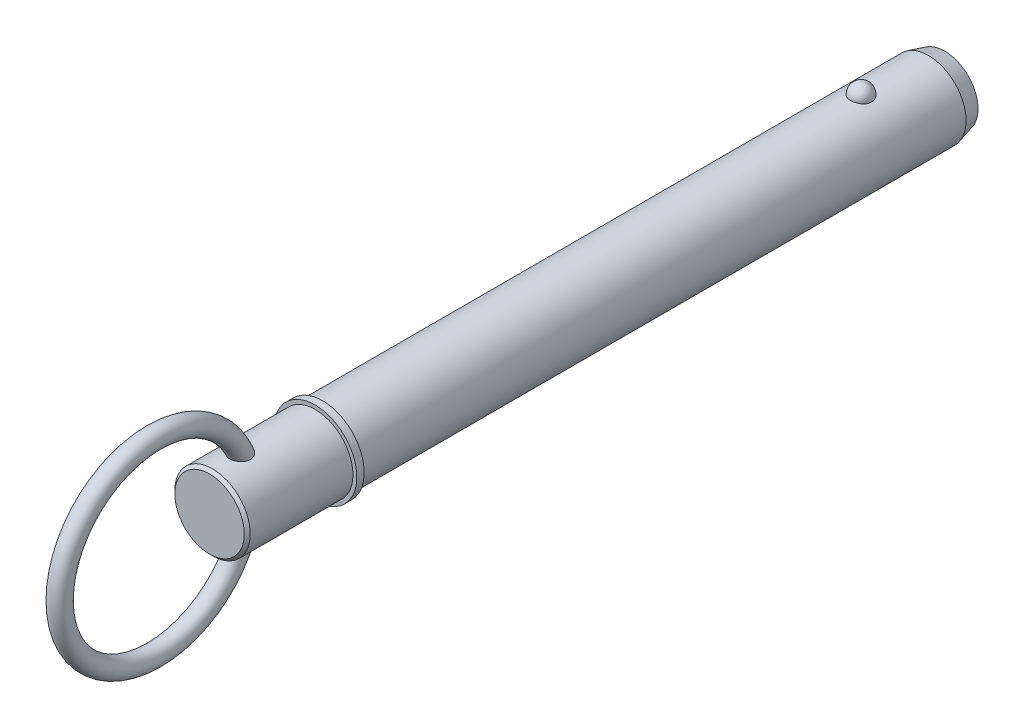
ISO-10303-21;
HEADER;
FILE_DESCRIPTION(('STEP AP214'),'2;1');
FILE_NAME('part.step','',(''),(''),'','','');
FILE_SCHEMA(('AUTOMOTIVE_DESIGN { 1 0 10303 214 1 1 1 1 }'));
ENDSEC;
DATA;
#1=APPLICATION_CONTEXT('core data for automotive mechanical design processes');
#2=APPLICATION_PROTOCOL_DEFINITION('international standard','automotive_design',2000,#1);
#3=PRODUCT_CONTEXT('',#1,'mechanical');
#4=PRODUCT('Part','Part','',(#3));
#5=PRODUCT_RELATED_PRODUCT_CATEGORY('part','',(#4));
#6=PRODUCT_DEFINITION_FORMATION('','',#4);
#7=PRODUCT_DEFINITION_CONTEXT('part definition',#1,'design');
#8=PRODUCT_DEFINITION('design','',#6,#7);
#9=PRODUCT_DEFINITION_SHAPE('','',#8);
#10=(LENGTH_UNIT() NAMED_UNIT(*) SI_UNIT(.MILLI.,.METRE.));
#11=(NAMED_UNIT(*) PLANE_ANGLE_UNIT() SI_UNIT($,.RADIAN.));
#12=(NAMED_UNIT(*) SI_UNIT($,.STERADIAN.) SOLID_ANGLE_UNIT());
#13=UNCERTAINTY_MEASURE_WITH_UNIT(LENGTH_MEASURE(1.E-05),#10,'distance_accuracy_value','');
#14=(GEOMETRIC_REPRESENTATION_CONTEXT(3) GLOBAL_UNCERTAINTY_ASSIGNED_CONTEXT((#13)) GLOBAL_UNIT_ASSIGNED_CONTEXT((#10,
#11,#12)) REPRESENTATION_CONTEXT('',''));
#15=CARTESIAN_POINT('',(0.,0.,0.));
#16=DIRECTION('',(0.,0.,1.));
#17=DIRECTION('',(1.,0.,0.));
#18=AXIS2_PLACEMENT_3D('',#15,#16,#17);
#19=CARTESIAN_POINT('',(0.,0.,177.8));
#20=DIRECTION('',(0.,0.,-1.));
#21=DIRECTION('',(-1.,0.,0.));
#22=AXIS2_PLACEMENT_3D('',#19,#20,#21);
#23=CYLINDRICAL_SURFACE('',#22,12.7);
#24=CARTESIAN_POINT('',(3.52486003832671,12.2010393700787,-3.56));
#25=CARTESIAN_POINT('',(3.52485671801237,12.2010422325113,-3.3610062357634));
#26=CARTESIAN_POINT('',(3.50863187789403,12.2057632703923,-3.16197042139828));
#27=CARTESIAN_POINT('',(3.4441205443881,12.2241207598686,-2.76953945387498));
#28=CARTESIAN_POINT('',(3.39582213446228,12.2377605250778,-2.57614642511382));
#29=CARTESIAN_POINT('',(3.26839193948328,12.2724057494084,-2.20059799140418));
#30=CARTESIAN_POINT('',(3.18927369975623,12.2934079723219,-2.01843769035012));
#31=CARTESIAN_POINT('',(3.00217139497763,12.3404306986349,-1.6703228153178));
#32=CARTESIAN_POINT('',(2.89418796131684,12.3664510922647,-1.50436788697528));
#33=CARTESIAN_POINT('',(2.65144862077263,12.4207616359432,-1.19241975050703));
#34=CARTESIAN_POINT('',(2.51656310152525,12.4490623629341,-1.04652919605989));
#35=CARTESIAN_POINT('',(2.22383249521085,12.5046678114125,-0.779711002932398));
#36=CARTESIAN_POINT('',(2.0659873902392,12.5319725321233,-0.658783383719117));
#37=CARTESIAN_POINT('',(1.73204520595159,12.5824645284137,-0.445586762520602));
#38=CARTESIAN_POINT('',(1.55600183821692,12.6056634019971,-0.353236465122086));
#39=CARTESIAN_POINT('',(1.19021695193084,12.6454411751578,-0.199381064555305));
#40=CARTESIAN_POINT('',(1.00047694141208,12.6620208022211,-0.137872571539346));
#41=CARTESIAN_POINT('',(0.616329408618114,12.6864692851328,-0.0483191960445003));
#42=CARTESIAN_POINT('',(0.422067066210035,12.6944893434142,-0.0196927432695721));
#43=CARTESIAN_POINT('',(0.0313259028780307,12.7014637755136,0.00524116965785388));
#44=CARTESIAN_POINT('',(-0.165152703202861,12.7004190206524,0.00155173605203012));
#45=CARTESIAN_POINT('',(-0.551780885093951,12.6894611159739,-0.0377454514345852));
#46=CARTESIAN_POINT('',(-0.74198078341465,12.6796749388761,-0.0728962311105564));
#47=CARTESIAN_POINT('',(-1.11361063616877,12.6524544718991,-0.173489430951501));
#48=CARTESIAN_POINT('',(-1.29504043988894,12.6350200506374,-0.238932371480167));
#49=CARTESIAN_POINT('',(-1.64521311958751,12.5942270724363,-0.398772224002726));
#50=CARTESIAN_POINT('',(-1.81387645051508,12.5708347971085,-0.493334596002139));
#51=CARTESIAN_POINT('',(-2.13292959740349,12.5206522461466,-0.708731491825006));
#52=CARTESIAN_POINT('',(-2.28331755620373,12.4938616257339,-0.829568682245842));
#53=CARTESIAN_POINT('',(-2.56470285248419,12.4391828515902,-1.0968714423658));
#54=CARTESIAN_POINT('',(-2.69527522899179,12.4112835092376,-1.24378221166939));
#55=CARTESIAN_POINT('',(-2.93023079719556,12.3579248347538,-1.55763192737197));
#56=CARTESIAN_POINT('',(-3.03461212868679,12.3324656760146,-1.72457229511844));
#57=CARTESIAN_POINT('',(-3.21564423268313,12.2865167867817,-2.07598316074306));
#58=CARTESIAN_POINT('',(-3.29196222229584,12.2660875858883,-2.26063321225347));
#59=CARTESIAN_POINT('',(-3.41323771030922,12.2328979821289,-2.64061334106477));
#60=CARTESIAN_POINT('',(-3.45819611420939,12.2201373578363,-2.83594310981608));
#61=CARTESIAN_POINT('',(-3.51550038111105,12.2037762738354,-3.2308649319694));
#62=CARTESIAN_POINT('',(-3.5279827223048,12.200137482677,-3.43043558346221));
#63=CARTESIAN_POINT('',(-3.52041430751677,12.2023234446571,-3.8289025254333));
#64=CARTESIAN_POINT('',(-3.50036443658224,12.2081479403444,-4.02779883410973));
#65=CARTESIAN_POINT('',(-3.42842010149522,12.2285446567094,-4.41824213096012));
#66=CARTESIAN_POINT('',(-3.37668525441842,12.243073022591,-4.6098208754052));
#67=CARTESIAN_POINT('',(-3.24279085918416,12.2792134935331,-4.98132360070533));
#68=CARTESIAN_POINT('',(-3.16063009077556,12.300825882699,-5.16124711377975));
#69=CARTESIAN_POINT('',(-2.96738224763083,12.3488691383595,-5.50542856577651));
#70=CARTESIAN_POINT('',(-2.85613997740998,12.3753256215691,-5.66959579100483));
#71=CARTESIAN_POINT('',(-2.60773241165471,12.4300386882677,-5.97665065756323));
#72=CARTESIAN_POINT('',(-2.47056612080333,12.458295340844,-6.11953748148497));
#73=CARTESIAN_POINT('',(-2.17327999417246,12.5135827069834,-6.38059312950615));
#74=CARTESIAN_POINT('',(-2.01307652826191,12.5406084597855,-6.49866785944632));
#75=CARTESIAN_POINT('',(-1.67442544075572,12.5902954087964,-6.70609314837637));
#76=CARTESIAN_POINT('',(-1.49597909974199,12.6129569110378,-6.79544572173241));
#77=CARTESIAN_POINT('',(-1.12819666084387,12.6511224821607,-6.94192787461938));
#78=CARTESIAN_POINT('',(-0.93902400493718,12.666712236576,-6.99944518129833));
#79=CARTESIAN_POINT('',(-0.553267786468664,12.6894125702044,-7.08227444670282));
#80=CARTESIAN_POINT('',(-0.356685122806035,12.6965241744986,-7.10759029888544));
#81=CARTESIAN_POINT('',(0.0343320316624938,12.7014305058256,-7.12510946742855));
#82=CARTESIAN_POINT('',(0.228736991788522,12.6993986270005,-7.11792901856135));
#83=CARTESIAN_POINT('',(0.613493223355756,12.6866339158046,-7.07206766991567));
#84=CARTESIAN_POINT('',(0.803844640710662,12.6759013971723,-7.03338790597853));
#85=CARTESIAN_POINT('',(1.17440741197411,12.6469443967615,-6.925834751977));
#86=CARTESIAN_POINT('',(1.35465462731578,12.6287486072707,-6.85707692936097));
#87=CARTESIAN_POINT('',(1.70092526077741,12.5867908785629,-6.69128257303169));
#88=CARTESIAN_POINT('',(1.86694777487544,12.5630285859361,-6.59424424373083));
#89=CARTESIAN_POINT('',(2.18289085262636,12.5120350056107,-6.3727748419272));
#90=CARTESIAN_POINT('',(2.33252391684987,12.4847559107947,-6.24794475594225));
#91=CARTESIAN_POINT('',(2.60889724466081,12.4299457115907,-5.97511730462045));
#92=CARTESIAN_POINT('',(2.73563353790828,12.4024145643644,-5.82711592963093));
#93=CARTESIAN_POINT('',(2.96505559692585,12.3495984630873,-5.5091226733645));
#94=CARTESIAN_POINT('',(3.06728335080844,12.3243610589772,-5.33879227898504));
#95=CARTESIAN_POINT('',(3.24218794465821,12.2795120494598,-4.98295005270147));
#96=CARTESIAN_POINT('',(3.31487538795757,12.2598984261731,-4.79744369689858));
#97=CARTESIAN_POINT('',(3.42255689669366,12.2302435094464,-4.43775244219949));
#98=CARTESIAN_POINT('',(3.46085292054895,12.2193780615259,-4.264615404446));
#99=CARTESIAN_POINT('',(3.5120056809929,12.2047747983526,-3.9143299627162));
#100=CARTESIAN_POINT('',(3.52486299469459,12.2010368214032,-3.73718164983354));
#101=CARTESIAN_POINT('',(3.52486003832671,12.2010393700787,-3.56));
#102=B_SPLINE_CURVE_WITH_KNOTS('',3,(#24,#25,#26,#27,#28,#29,#30,#31,#32,#33,#34,#35,#36,#37,
#38,#39,#40,#41,#42,#43,#44,#45,#46,#47,#48,#49,#50,#51,#52,#53,#54,#55,#56,#57,#58,#59,#60,#61,
#62,#63,#64,#65,#66,#67,#68,#69,#70,#71,#72,#73,#74,#75,#76,#77,#78,#79,#80,#81,#82,#83,#84,#85,
#86,#87,#88,#89,#90,#91,#92,#93,#94,#95,#96,#97,#98,#99,#100,#101),.UNSPECIFIED.,.T.,.F.,(4,2,2,
2,2,2,2,2,2,2,2,2,2,2,2,2,2,2,2,2,2,2,2,2,2,2,2,2,2,2,2,2,2,2,2,2,2,2,4),(0.,0.596344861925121,
1.19291141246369,1.78921606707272,2.38550767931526,2.98474477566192,3.58398233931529,
4.18149920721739,4.77895038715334,5.36566361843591,5.95232045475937,6.53059198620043,
7.10887345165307,7.6905033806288,8.27219236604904,8.86498552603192,9.45782077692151,
10.0574751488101,10.6571122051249,11.2542252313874,11.8513220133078,12.4454353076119,
13.0395724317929,13.636947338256,14.2343451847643,14.8339691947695,15.4335511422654,
16.0256602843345,16.6176978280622,17.1985559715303,17.7793931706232,18.3580179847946,
18.9366795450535,19.5242567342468,20.1119357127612,20.7098642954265,21.3075780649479,
21.8385683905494,22.3695466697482),.UNSPECIFIED.);
#103=CARTESIAN_POINT('',(3.52486003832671,12.2010393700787,-3.56));
#104=VERTEX_POINT('',#103);
#105=EDGE_CURVE('E101',#104,#104,#102,.T.);
#106=ORIENTED_EDGE('',*,*,#105,.T.);
#107=EDGE_LOOP('',(#106));
#108=FACE_BOUND('',#107,.T.);
#109=CARTESIAN_POINT('',(0.,0.,-26.2499999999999));
#110=DIRECTION('',(0.,0.,-1.));
#111=DIRECTION('',(-1.,0.,0.));
#112=AXIS2_PLACEMENT_3D('',#109,#110,#111);
#113=CIRCLE('',#112,12.7);
#114=CARTESIAN_POINT('',(-12.7,0.,-26.2499999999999));
#115=VERTEX_POINT('',#114);
#116=EDGE_CURVE('E109',#115,#115,#113,.F.);
#117=ORIENTED_EDGE('',*,*,#116,.T.);
#118=EDGE_LOOP('',(#117));
#119=FACE_BOUND('',#118,.T.);
#120=CARTESIAN_POINT('',(0.,0.,177.8));
#121=DIRECTION('',(0.,0.,1.));
#122=DIRECTION('',(1.,0.,0.));
#123=AXIS2_PLACEMENT_3D('',#120,#121,#122);
#124=CIRCLE('',#123,12.7);
#125=CARTESIAN_POINT('',(12.7,0.,177.8));
#126=VERTEX_POINT('',#125);
#127=EDGE_CURVE('E107',#126,#126,#124,.T.);
#128=ORIENTED_EDGE('',*,*,#127,.F.);
#129=EDGE_LOOP('',(#128));
#130=FACE_BOUND('',#129,.T.);
#131=ADVANCED_FACE('F39',(#108,#119,#130),#23,.T.);
#132=CARTESIAN_POINT('',(0.,0.,-31.75));
#133=DIRECTION('',(0.,0.,-1.));
#134=DIRECTION('',(-1.,0.,0.));
#135=AXIS2_PLACEMENT_3D('',#132,#133,#134);
#136=PLANE('',#135);
#137=CARTESIAN_POINT('',(0.,0.,-31.75));
#138=DIRECTION('',(0.,0.,-1.));
#139=DIRECTION('',(-1.,0.,0.));
#140=AXIS2_PLACEMENT_3D('',#137,#138,#139);
#141=CIRCLE('',#140,11.2262794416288);
#142=CARTESIAN_POINT('',(-11.2262794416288,0.,-31.75));
#143=VERTEX_POINT('',#142);
#144=EDGE_CURVE('E141',#143,#143,#141,.T.);
#145=ORIENTED_EDGE('',*,*,#144,.T.);
#146=EDGE_LOOP('',(#145));
#147=FACE_BOUND('',#146,.T.);
#148=ADVANCED_FACE('F87',(#147),#136,.T.);
#149=CARTESIAN_POINT('',(0.,0.,-31.75));
#150=DIRECTION('',(0.,0.,1.));
#151=DIRECTION('',(1.,0.,0.));
#152=AXIS2_PLACEMENT_3D('',#149,#150,#151);
#153=CONICAL_SURFACE('',#152,11.2262794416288,0.261799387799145);
#154=ORIENTED_EDGE('',*,*,#116,.F.);
#155=EDGE_LOOP('',(#154));
#156=FACE_BOUND('',#155,.T.);
#157=ORIENTED_EDGE('',*,*,#144,.F.);
#158=EDGE_LOOP('',(#157));
#159=FACE_BOUND('',#158,.T.);
#160=ADVANCED_FACE('F93',(#156,#159),#153,.T.);
#161=CARTESIAN_POINT('',(0.,12.7,-3.56));
#162=DIRECTION('',(0.,1.,0.));
#163=DIRECTION('',(0.,0.,1.));
#164=AXIS2_PLACEMENT_3D('',#161,#162,#163);
#165=SPHERICAL_SURFACE('',#164,3.56);
#166=ORIENTED_EDGE('',*,*,#105,.F.);
#167=EDGE_LOOP('',(#166));
#168=FACE_BOUND('',#167,.T.);
#169=ADVANCED_FACE('F112',(#168),#165,.T.);
#170=CARTESIAN_POINT('',(0.,0.,177.8));
#171=DIRECTION('',(0.,0.,-1.));
#172=DIRECTION('',(-1.,0.,0.));
#173=AXIS2_PLACEMENT_3D('',#170,#171,#172);
#174=PLANE('',#173);
#175=ORIENTED_EDGE('',*,*,#127,.T.);
#176=EDGE_LOOP('',(#175));
#177=FACE_BOUND('',#176,.T.);
#178=CARTESIAN_POINT('',(0.,0.,177.8));
#179=DIRECTION('',(0.,0.,-1.));
#180=DIRECTION('',(-1.,0.,0.));
#181=AXIS2_PLACEMENT_3D('',#178,#179,#180);
#182=CIRCLE('',#181,14.);
#183=CARTESIAN_POINT('',(-14.,0.,177.8));
#184=VERTEX_POINT('',#183);
#185=EDGE_CURVE('E108',#184,#184,#182,.T.);
#186=ORIENTED_EDGE('',*,*,#185,.T.);
#187=EDGE_LOOP('',(#186));
#188=FACE_BOUND('',#187,.T.);
#189=ADVANCED_FACE('F116',(#177,#188),#174,.T.);
#190=CARTESIAN_POINT('',(0.,0.,33.7287874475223));
#191=DIRECTION('',(0.,0.,-1.));
#192=DIRECTION('',(-1.,0.,0.));
#193=AXIS2_PLACEMENT_3D('',#190,#191,#192);
#194=CYLINDRICAL_SURFACE('',#193,14.);
#195=CARTESIAN_POINT('',(0.,0.,180.3));
#196=DIRECTION('',(0.,0.,-1.));
#197=DIRECTION('',(-1.,0.,0.));
#198=AXIS2_PLACEMENT_3D('',#195,#196,#197);
#199=CIRCLE('',#198,14.);
#200=CARTESIAN_POINT('',(-14.,0.,180.3));
#201=VERTEX_POINT('',#200);
#202=EDGE_CURVE('E133',#201,#201,#199,.T.);
#203=ORIENTED_EDGE('',*,*,#202,.T.);
#204=EDGE_LOOP('',(#203));
#205=FACE_BOUND('',#204,.T.);
#206=ORIENTED_EDGE('',*,*,#185,.F.);
#207=EDGE_LOOP('',(#206));
#208=FACE_BOUND('',#207,.T.);
#209=ADVANCED_FACE('F120',(#205,#208),#194,.T.);
#210=CARTESIAN_POINT('',(0.,14.,180.3));
#211=DIRECTION('',(0.,0.,1.));
#212=DIRECTION('',(1.,0.,0.));
#213=AXIS2_PLACEMENT_3D('',#210,#211,#212);
#214=PLANE('',#213);
#215=CARTESIAN_POINT('',(0.,0.,180.3));
#216=DIRECTION('',(0.,0.,1.));
#217=DIRECTION('',(1.,0.,0.));
#218=AXIS2_PLACEMENT_3D('',#215,#216,#217);
#219=CIRCLE('',#218,12.7);
#220=CARTESIAN_POINT('',(12.7,0.,180.3));
#221=VERTEX_POINT('',#220);
#222=EDGE_CURVE('E111',#221,#221,#219,.T.);
#223=ORIENTED_EDGE('',*,*,#222,.F.);
#224=EDGE_LOOP('',(#223));
#225=FACE_BOUND('',#224,.T.);
#226=ORIENTED_EDGE('',*,*,#202,.F.);
#227=EDGE_LOOP('',(#226));
#228=FACE_BOUND('',#227,.T.);
#229=ADVANCED_FACE('F84',(#225,#228),#214,.T.);
#230=CARTESIAN_POINT('',(0.,0.,215.9));
#231=DIRECTION('',(0.,0.,-1.));
#232=DIRECTION('',(-1.,0.,0.));
#233=AXIS2_PLACEMENT_3D('',#230,#231,#232);
#234=CYLINDRICAL_SURFACE('',#233,12.7);
#235=CARTESIAN_POINT('',(-1.22892607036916,-12.6404011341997,202.27119395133));
#236=CARTESIAN_POINT('',(-1.06119922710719,-12.6567092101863,202.204004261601));
#237=CARTESIAN_POINT('',(-0.887663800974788,-12.6701810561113,202.150792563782));
#238=CARTESIAN_POINT('',(-0.533823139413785,-12.6900116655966,202.073419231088));
#239=CARTESIAN_POINT('',(-0.353518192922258,-12.6963707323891,202.0492563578));
#240=CARTESIAN_POINT('',(0.0087115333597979,-12.7012887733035,202.030519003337));
#241=CARTESIAN_POINT('',(0.190636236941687,-12.699848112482,202.035943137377));
#242=CARTESIAN_POINT('',(0.5509718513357,-12.6893231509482,202.076255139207));
#243=CARTESIAN_POINT('',(0.729382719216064,-12.6802387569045,202.11114336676));
#244=CARTESIAN_POINT('',(1.07771687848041,-12.6553960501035,202.209659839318));
#245=CARTESIAN_POINT('',(1.24763507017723,-12.6396337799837,202.273305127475));
#246=CARTESIAN_POINT('',(1.57398922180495,-12.6031560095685,202.427891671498));
#247=CARTESIAN_POINT('',(1.73042571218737,-12.5824407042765,202.518831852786));
#248=CARTESIAN_POINT('',(2.02464767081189,-12.5384554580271,202.725320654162));
#249=CARTESIAN_POINT('',(2.16251370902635,-12.5151974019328,202.84075697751));
#250=CARTESIAN_POINT('',(2.41652917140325,-12.4686447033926,203.093426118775));
#251=CARTESIAN_POINT('',(2.53268123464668,-12.4453500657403,203.230656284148));
#252=CARTESIAN_POINT('',(2.7397169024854,-12.4014166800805,203.52226178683));
#253=CARTESIAN_POINT('',(2.83072997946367,-12.3807646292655,203.676543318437));
#254=CARTESIAN_POINT('',(2.98642630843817,-12.3441356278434,203.998338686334));
#255=CARTESIAN_POINT('',(3.05110876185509,-12.3281588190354,204.165852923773));
#256=CARTESIAN_POINT('',(3.15450336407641,-12.3021148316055,204.512705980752));
#257=CARTESIAN_POINT('',(3.19268116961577,-12.2921697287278,204.692212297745));
#258=CARTESIAN_POINT('',(3.24150148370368,-12.2793848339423,205.055144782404));
#259=CARTESIAN_POINT('',(3.25213515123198,-12.2765473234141,205.238572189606));
#260=CARTESIAN_POINT('',(3.24696781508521,-12.2779158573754,205.618893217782));
#261=CARTESIAN_POINT('',(3.22910261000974,-12.2826719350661,205.815753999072));
#262=CARTESIAN_POINT('',(3.16504953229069,-12.2993299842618,206.20447917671));
#263=CARTESIAN_POINT('',(3.11884966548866,-12.3112349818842,206.396341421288));
#264=CARTESIAN_POINT('',(2.99323123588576,-12.3424162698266,206.792891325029));
#265=CARTESIAN_POINT('',(2.91059577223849,-12.3623844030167,206.996505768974));
#266=CARTESIAN_POINT('',(2.71447440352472,-12.4069229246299,207.388190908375));
#267=CARTESIAN_POINT('',(2.60094970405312,-12.431499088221,207.576241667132));
#268=CARTESIAN_POINT('',(2.40499526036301,-12.4703951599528,207.847470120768));
#269=CARTESIAN_POINT('',(2.3330184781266,-12.4841083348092,207.938407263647));
#270=CARTESIAN_POINT('',(2.18106597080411,-12.5115521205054,208.113320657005));
#271=CARTESIAN_POINT('',(2.10108885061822,-12.5252827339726,208.197295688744));
#272=CARTESIAN_POINT('',(1.8497396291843,-12.5657115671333,208.436779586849));
#273=CARTESIAN_POINT('',(1.6664677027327,-12.5917488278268,208.580526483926));
#274=CARTESIAN_POINT('',(1.33551340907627,-12.6303067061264,208.785856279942));
#275=CARTESIAN_POINT('',(1.1951213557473,-12.6444898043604,208.85902243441));
#276=CARTESIAN_POINT('',(0.90394580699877,-12.6686276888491,208.981586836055));
#277=CARTESIAN_POINT('',(0.753173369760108,-12.6785868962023,209.031009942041));
#278=CARTESIAN_POINT('',(0.444090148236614,-12.6931800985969,209.102942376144));
#279=CARTESIAN_POINT('',(0.285741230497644,-12.6977833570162,209.125296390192));
#280=CARTESIAN_POINT('',(-0.0324491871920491,-12.700953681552,209.140724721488));
#281=CARTESIAN_POINT('',(-0.19229038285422,-12.6995219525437,209.133804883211));
#282=CARTESIAN_POINT('',(-0.493822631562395,-12.6912132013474,209.093209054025));
#283=CARTESIAN_POINT('',(-0.635865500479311,-12.6848307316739,209.061962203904));
#284=CARTESIAN_POINT('',(-0.913041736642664,-12.6678986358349,208.977721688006));
#285=CARTESIAN_POINT('',(-1.04817349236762,-12.6573480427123,208.924722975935));
#286=CARTESIAN_POINT('',(-1.31637898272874,-12.6323524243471,208.796233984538));
#287=CARTESIAN_POINT('',(-1.44890088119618,-12.6177203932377,208.719638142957));
#288=CARTESIAN_POINT('',(-1.70162176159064,-12.5861326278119,208.548743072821));
#289=CARTESIAN_POINT('',(-1.82181486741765,-12.569175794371,208.454435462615));
#290=CARTESIAN_POINT('',(-2.06961284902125,-12.5309682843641,208.232665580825));
#291=CARTESIAN_POINT('',(-2.19457628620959,-12.5094982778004,208.10229330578));
#292=CARTESIAN_POINT('',(-2.42503767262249,-12.4668738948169,207.825308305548));
#293=CARTESIAN_POINT('',(-2.53052086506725,-12.4457197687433,207.678683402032));
#294=CARTESIAN_POINT('',(-2.73961150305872,-12.4015349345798,207.343065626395));
#295=CARTESIAN_POINT('',(-2.83895917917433,-12.3789253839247,207.151346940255));
#296=CARTESIAN_POINT('',(-3.00725804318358,-12.3391195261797,206.754405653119));
#297=CARTESIAN_POINT('',(-3.0761885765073,-12.3219268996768,206.549173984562));
#298=CARTESIAN_POINT('',(-3.18528660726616,-12.2942052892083,206.113754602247));
#299=CARTESIAN_POINT('',(-3.22287145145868,-12.2842816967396,205.882855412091));
#300=CARTESIAN_POINT('',(-3.24821271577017,-12.2775854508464,205.534351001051));
#301=CARTESIAN_POINT('',(-3.25148236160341,-12.276719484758,205.417777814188));
#302=CARTESIAN_POINT('',(-3.24729041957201,-12.2778310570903,205.184859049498));
#303=CARTESIAN_POINT('',(-3.23983534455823,-12.2798068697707,205.068513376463));
#304=CARTESIAN_POINT('',(-3.21488959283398,-12.286359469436,204.84622762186));
#305=CARTESIAN_POINT('',(-3.19823165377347,-12.2907201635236,204.740186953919));
#306=CARTESIAN_POINT('',(-3.15537465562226,-12.3017926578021,204.53022257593));
#307=CARTESIAN_POINT('',(-3.12918076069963,-12.3085031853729,204.426297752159));
#308=CARTESIAN_POINT('',(-3.06721568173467,-12.3240904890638,204.221553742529));
#309=CARTESIAN_POINT('',(-3.0314485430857,-12.3329663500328,204.120733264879));
#310=CARTESIAN_POINT('',(-2.95042598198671,-12.3525998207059,203.923171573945));
#311=CARTESIAN_POINT('',(-2.90517160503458,-12.3633572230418,203.826429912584));
#312=CARTESIAN_POINT('',(-2.81116315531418,-12.3850478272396,203.648857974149));
#313=CARTESIAN_POINT('',(-2.76340897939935,-12.3958187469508,203.567476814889));
#314=CARTESIAN_POINT('',(-2.66091958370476,-12.4182228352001,203.409317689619));
#315=CARTESIAN_POINT('',(-2.60618212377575,-12.4298562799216,203.332541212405));
#316=CARTESIAN_POINT('',(-2.4901313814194,-12.4536239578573,203.184278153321));
#317=CARTESIAN_POINT('',(-2.42882150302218,-12.4657579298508,203.112788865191));
#318=CARTESIAN_POINT('',(-2.30002146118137,-12.4901640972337,202.975587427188));
#319=CARTESIAN_POINT('',(-2.23252894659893,-12.5024363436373,202.909877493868));
#320=CARTESIAN_POINT('',(-2.09370795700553,-12.5264205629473,202.786377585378));
#321=CARTESIAN_POINT('',(-2.02252382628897,-12.5381388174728,202.728426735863));
#322=CARTESIAN_POINT('',(-1.87531735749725,-12.5610012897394,202.61889123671));
#323=CARTESIAN_POINT('',(-1.79929316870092,-12.5721452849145,202.567309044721));
#324=CARTESIAN_POINT('',(-1.56485282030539,-12.6042047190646,202.422706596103));
#325=CARTESIAN_POINT('',(-1.39990754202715,-12.6237766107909,202.339687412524));
#326=CARTESIAN_POINT('',(-1.22892607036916,-12.6404011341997,202.27119395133));
#327=B_SPLINE_CURVE_WITH_KNOTS('',3,(#235,#236,#237,#238,#239,#240,#241,#242,#243,#244,#245,
#246,#247,#248,#249,#250,#251,#252,#253,#254,#255,#256,#257,#258,#259,#260,#261,#262,#263,#264,
#265,#266,#267,#268,#269,#270,#271,#272,#273,#274,#275,#276,#277,#278,#279,#280,#281,#282,#283,
#284,#285,#286,#287,#288,#289,#290,#291,#292,#293,#294,#295,#296,#297,#298,#299,#300,#301,#302,
#303,#304,#305,#306,#307,#308,#309,#310,#311,#312,#313,#314,#315,#316,#317,#318,#319,#320,#321,
#322,#323,#324,#325,#326),.UNSPECIFIED.,.T.,.F.,(4,2,2,2,2,2,2,2,2,2,2,2,2,2,2,2,2,2,2,2,2,2,2,
2,2,2,2,2,2,2,2,2,2,2,2,2,2,2,2,2,2,2,2,2,2,4),(0.,0.543509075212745,1.08699497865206,
1.63045544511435,2.17392254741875,2.71771216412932,3.26148037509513,3.80280767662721,
4.34406914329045,4.88248866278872,5.42092451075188,5.9699227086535,6.51909710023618,
7.10988630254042,7.70092576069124,8.36013748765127,9.02018098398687,9.37009147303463,
9.72006308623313,10.4175255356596,10.8925536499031,11.3670833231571,11.844322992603,
12.3214673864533,12.7562647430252,13.1911630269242,13.6507378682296,14.110530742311,
14.6541210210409,15.198121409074,15.8467121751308,16.4957426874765,17.1940750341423,
17.5435132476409,17.8927393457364,18.2145822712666,18.536251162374,18.8577843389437,
19.1792821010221,19.4638320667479,19.7484735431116,20.0329683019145,20.3175717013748,
20.5948148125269,20.8721645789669,21.4262200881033),.UNSPECIFIED.);
#328=CARTESIAN_POINT('',(-1.22892607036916,-12.6404011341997,202.27119395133));
#329=VERTEX_POINT('',#328);
#330=EDGE_CURVE('E10',#329,#329,#327,.T.);
#331=ORIENTED_EDGE('',*,*,#330,.F.);
#332=EDGE_LOOP('',(#331));
#333=FACE_BOUND('',#332,.T.);
#334=CARTESIAN_POINT('',(-1.22892607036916,12.6404011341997,202.27119395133));
#335=CARTESIAN_POINT('',(-1.39512541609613,12.624240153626,202.33776712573));
#336=CARTESIAN_POINT('',(-1.55582432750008,12.6052778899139,202.418153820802));
#337=CARTESIAN_POINT('',(-1.86136954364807,12.5638060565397,202.604658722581));
#338=CARTESIAN_POINT('',(-2.00617769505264,12.5412882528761,202.710836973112));
#339=CARTESIAN_POINT('',(-2.27547906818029,12.4952333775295,202.946103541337));
#340=CARTESIAN_POINT('',(-2.3999874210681,12.4716970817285,203.075174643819));
#341=CARTESIAN_POINT('',(-2.62534229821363,12.4262157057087,203.352623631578));
#342=CARTESIAN_POINT('',(-2.72620384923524,12.4042696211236,203.500989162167));
#343=CARTESIAN_POINT('',(-2.90197976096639,12.3643304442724,203.8126750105));
#344=CARTESIAN_POINT('',(-2.97691335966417,12.346334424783,203.975984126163));
#345=CARTESIAN_POINT('',(-3.09983588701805,12.3160482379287,204.312927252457));
#346=CARTESIAN_POINT('',(-3.14781852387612,12.3037594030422,204.486563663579));
#347=CARTESIAN_POINT('',(-3.21809353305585,12.2855709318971,204.845523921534));
#348=CARTESIAN_POINT('',(-3.23943500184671,12.2799082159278,205.031044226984));
#349=CARTESIAN_POINT('',(-3.2544382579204,12.2759385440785,205.403232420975));
#350=CARTESIAN_POINT('',(-3.24809142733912,12.2776338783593,205.589900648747));
#351=CARTESIAN_POINT('',(-3.20755159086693,12.288291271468,205.977577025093));
#352=CARTESIAN_POINT('',(-3.17081691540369,12.2979162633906,206.178299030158));
#353=CARTESIAN_POINT('',(-3.06845850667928,12.3238513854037,206.571858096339));
#354=CARTESIAN_POINT('',(-3.00281105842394,12.3401670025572,206.764688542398));
#355=CARTESIAN_POINT('',(-2.83560995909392,12.3797223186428,207.159473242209));
#356=CARTESIAN_POINT('',(-2.73085133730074,12.4035339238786,207.360019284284));
#357=CARTESIAN_POINT('',(-2.48976141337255,12.4541651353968,207.740813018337));
#358=CARTESIAN_POINT('',(-2.35343772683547,12.4809840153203,207.921065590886));
#359=CARTESIAN_POINT('',(-2.07683984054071,12.5296806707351,208.22565995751));
#360=CARTESIAN_POINT('',(-1.94129351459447,12.551613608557,208.354283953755));
#361=CARTESIAN_POINT('',(-1.65081707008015,12.5931023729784,208.587836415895));
#362=CARTESIAN_POINT('',(-1.49591505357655,12.6126615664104,208.692798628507));
#363=CARTESIAN_POINT('',(-1.19690065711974,12.6442092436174,208.857788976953));
#364=CARTESIAN_POINT('',(-1.0554126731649,12.6569190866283,208.922418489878));
#365=CARTESIAN_POINT('',(-0.76341583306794,12.6778764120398,209.027638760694));
#366=CARTESIAN_POINT('',(-0.612913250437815,12.6861269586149,209.068246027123));
#367=CARTESIAN_POINT('',(-0.306168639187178,12.697239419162,209.122715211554));
#368=CARTESIAN_POINT('',(-0.149903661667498,12.7000767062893,209.136454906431));
#369=CARTESIAN_POINT('',(0.16255262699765,12.699920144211,209.13569423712));
#370=CARTESIAN_POINT('',(0.318743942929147,12.6969267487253,209.121196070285));
#371=CARTESIAN_POINT('',(0.614555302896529,12.6859231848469,209.067234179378));
#372=CARTESIAN_POINT('',(0.754548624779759,12.6782987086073,209.029687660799));
#373=CARTESIAN_POINT('',(1.0268504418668,12.6591561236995,208.933711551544));
#374=CARTESIAN_POINT('',(1.15915690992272,12.6476369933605,208.875276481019));
#375=CARTESIAN_POINT('',(1.42405861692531,12.6206654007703,208.734988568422));
#376=CARTESIAN_POINT('',(1.5558287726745,12.604971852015,208.651635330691));
#377=CARTESIAN_POINT('',(1.80621935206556,12.571537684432,208.467498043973));
#378=CARTESIAN_POINT('',(1.92483289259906,12.5537960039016,208.366704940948));
#379=CARTESIAN_POINT('',(2.16936918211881,12.5140714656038,208.130174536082));
#380=CARTESIAN_POINT('',(2.29236422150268,12.4919255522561,207.991439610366));
#381=CARTESIAN_POINT('',(2.5176248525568,12.4484835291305,207.697913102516));
#382=CARTESIAN_POINT('',(2.61987416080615,12.4271880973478,207.543109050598));
#383=CARTESIAN_POINT('',(2.81956306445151,12.3835520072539,207.191316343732));
#384=CARTESIAN_POINT('',(2.91268031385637,12.3617361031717,206.991798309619));
#385=CARTESIAN_POINT('',(3.06675738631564,12.3244204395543,206.579898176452));
#386=CARTESIAN_POINT('',(3.12769905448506,12.3089242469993,206.367508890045));
#387=CARTESIAN_POINT('',(3.19410612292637,12.2917937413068,206.037729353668));
#388=CARTESIAN_POINT('',(3.21217746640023,12.2870696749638,205.922917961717));
#389=CARTESIAN_POINT('',(3.23822570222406,12.2802317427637,205.692095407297));
#390=CARTESIAN_POINT('',(3.24620727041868,12.2781166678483,205.57608482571));
#391=CARTESIAN_POINT('',(3.25166839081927,12.2766712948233,205.34381042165));
#392=CARTESIAN_POINT('',(3.24914931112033,12.2773406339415,205.227546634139));
#393=CARTESIAN_POINT('',(3.23325304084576,12.2815367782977,204.995869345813));
#394=CARTESIAN_POINT('',(3.2198826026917,12.2850618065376,204.88045536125));
#395=CARTESIAN_POINT('',(3.18378347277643,12.2944635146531,204.662188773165));
#396=CARTESIAN_POINT('',(3.16203615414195,12.3000921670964,204.559162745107));
#397=CARTESIAN_POINT('',(3.10931056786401,12.3135262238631,204.355694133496));
#398=CARTESIAN_POINT('',(3.0783372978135,12.3213304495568,204.25525018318));
#399=CARTESIAN_POINT('',(3.00719503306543,12.3388864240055,204.057882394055));
#400=CARTESIAN_POINT('',(2.96702904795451,12.34863753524,203.960957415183));
#401=CARTESIAN_POINT('',(2.87766260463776,12.3697681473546,203.77155308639));
#402=CARTESIAN_POINT('',(2.82846300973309,12.3811474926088,203.679073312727));
#403=CARTESIAN_POINT('',(2.72718770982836,12.4038233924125,203.509278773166));
#404=CARTESIAN_POINT('',(2.67601025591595,12.4149937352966,203.431409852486));
#405=CARTESIAN_POINT('',(2.56702778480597,12.4379850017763,203.280514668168));
#406=CARTESIAN_POINT('',(2.50922051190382,12.4498061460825,203.207490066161));
#407=CARTESIAN_POINT('',(2.3874143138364,12.4737362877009,203.066915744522));
#408=CARTESIAN_POINT('',(2.32341881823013,12.4858451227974,202.999363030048));
#409=CARTESIAN_POINT('',(2.18967865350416,12.5099935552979,202.870183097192));
#410=CARTESIAN_POINT('',(2.11993188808,12.5220331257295,202.808558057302));
#411=CARTESIAN_POINT('',(1.90863625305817,12.5565453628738,202.637971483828));
#412=CARTESIAN_POINT('',(1.75996750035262,12.5784460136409,202.537508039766));
#413=CARTESIAN_POINT('',(1.44761854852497,12.6182083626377,202.362748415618));
#414=CARTESIAN_POINT('',(1.28394037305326,12.6360706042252,202.288448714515));
#415=CARTESIAN_POINT('',(0.94588781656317,12.6658634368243,202.167537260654));
#416=CARTESIAN_POINT('',(0.771499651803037,12.6777861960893,202.120962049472));
#417=CARTESIAN_POINT('',(0.417041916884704,12.694390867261,202.056673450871));
#418=CARTESIAN_POINT('',(0.236969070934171,12.6990685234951,202.038977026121));
#419=CARTESIAN_POINT('',(-0.124879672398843,12.7006841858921,202.032829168));
#420=CARTESIAN_POINT('',(-0.306658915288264,12.6975703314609,202.044573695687));
#421=CARTESIAN_POINT('',(-0.665297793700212,12.6838264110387,202.097473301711));
#422=CARTESIAN_POINT('',(-0.842168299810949,12.6732146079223,202.138556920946));
#423=CARTESIAN_POINT('',(-1.0502551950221,12.6565519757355,202.205394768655));
#424=CARTESIAN_POINT('',(-1.08632235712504,12.6535053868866,202.217681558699));
#425=CARTESIAN_POINT('',(-1.15798463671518,12.6471484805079,202.243501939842));
#426=CARTESIAN_POINT('',(-1.19357974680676,12.643838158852,202.25703555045));
#427=CARTESIAN_POINT('',(-1.22892607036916,12.6404011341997,202.27119395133));
#428=B_SPLINE_CURVE_WITH_KNOTS('',3,(#334,#335,#336,#337,#338,#339,#340,#341,#342,#343,#344,
#345,#346,#347,#348,#349,#350,#351,#352,#353,#354,#355,#356,#357,#358,#359,#360,#361,#362,#363,
#364,#365,#366,#367,#368,#369,#370,#371,#372,#373,#374,#375,#376,#377,#378,#379,#380,#381,#382,
#383,#384,#385,#386,#387,#388,#389,#390,#391,#392,#393,#394,#395,#396,#397,#398,#399,#400,#401,
#402,#403,#404,#405,#406,#407,#408,#409,#410,#411,#412,#413,#414,#415,#416,#417,#418,#419,#420,
#421,#422,#423,#424,#425,#426,#427),.UNSPECIFIED.,.T.,.F.,(4,2,2,2,2,2,2,2,2,2,2,2,2,2,2,2,2,2,
2,2,2,2,2,2,2,2,2,2,2,2,2,2,2,2,2,2,2,2,2,2,2,2,2,2,2,2,4),(0.,0.539146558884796,
1.07956050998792,1.6195697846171,2.15923496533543,2.69849886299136,3.23788860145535,
3.79602631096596,4.3543377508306,4.96471598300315,5.57559579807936,6.2550948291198,
6.93443009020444,7.4967142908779,8.05819140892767,8.52445959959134,8.99040698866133,
9.45846913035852,9.92649485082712,10.3600530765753,10.7937251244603,11.2621204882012,
11.7307597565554,12.2888675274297,12.8474116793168,13.5084064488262,14.1697737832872,
14.5183408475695,14.8667463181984,15.2151063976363,15.5632498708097,15.8791508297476,
16.1948809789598,16.5105079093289,16.826104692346,17.1072964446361,17.3885841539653,
17.669716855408,17.9509524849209,18.490448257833,19.0298713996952,19.5700039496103,
20.1104536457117,20.6545101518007,21.1972460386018,21.3119068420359,21.4265694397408),.UNSPECIFIED.);
#429=CARTESIAN_POINT('',(-1.22892607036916,12.6404011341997,202.27119395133));
#430=VERTEX_POINT('',#429);
#431=EDGE_CURVE('E51',#430,#430,#428,.T.);
#432=ORIENTED_EDGE('',*,*,#431,.F.);
#433=EDGE_LOOP('',(#432));
#434=FACE_BOUND('',#433,.T.);
#435=CARTESIAN_POINT('',(0.,0.,214.9));
#436=DIRECTION('',(0.,0.,-1.));
#437=DIRECTION('',(-1.,0.,0.));
#438=AXIS2_PLACEMENT_3D('',#435,#436,#437);
#439=CIRCLE('',#438,12.7);
#440=CARTESIAN_POINT('',(-12.7,0.,214.9));
#441=VERTEX_POINT('',#440);
#442=EDGE_CURVE('E63',#441,#441,#439,.T.);
#443=ORIENTED_EDGE('',*,*,#442,.T.);
#444=EDGE_LOOP('',(#443));
#445=FACE_BOUND('',#444,.T.);
#446=ORIENTED_EDGE('',*,*,#222,.T.);
#447=EDGE_LOOP('',(#446));
#448=FACE_BOUND('',#447,.T.);
#449=ADVANCED_FACE('F68',(#333,#434,#445,#448),#234,.T.);
#450=CARTESIAN_POINT('',(0.,0.,215.9));
#451=DIRECTION('',(0.,0.,-1.));
#452=DIRECTION('',(-1.,0.,0.));
#453=AXIS2_PLACEMENT_3D('',#450,#451,#452);
#454=PLANE('',#453);
#455=CARTESIAN_POINT('',(0.,0.,215.9));
#456=DIRECTION('',(0.,0.,-1.));
#457=DIRECTION('',(-1.,0.,0.));
#458=AXIS2_PLACEMENT_3D('',#455,#456,#457);
#459=CIRCLE('',#458,11.6999999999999);
#460=CARTESIAN_POINT('',(-11.6999999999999,0.,215.9));
#461=VERTEX_POINT('',#460);
#462=EDGE_CURVE('E58',#461,#461,#459,.F.);
#463=ORIENTED_EDGE('',*,*,#462,.T.);
#464=EDGE_LOOP('',(#463));
#465=FACE_BOUND('',#464,.T.);
#466=ADVANCED_FACE('F75',(#465),#454,.F.);
#467=CARTESIAN_POINT('',(0.,0.,214.9));
#468=DIRECTION('',(0.,0.,-1.));
#469=DIRECTION('',(-1.,0.,0.));
#470=AXIS2_PLACEMENT_3D('',#467,#468,#469);
#471=CONICAL_SURFACE('',#470,12.7,0.785398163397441);
#472=ORIENTED_EDGE('',*,*,#462,.F.);
#473=EDGE_LOOP('',(#472));
#474=FACE_BOUND('',#473,.T.);
#475=ORIENTED_EDGE('',*,*,#442,.F.);
#476=EDGE_LOOP('',(#475));
#477=FACE_BOUND('',#476,.T.);
#478=ADVANCED_FACE('F41',(#474,#477),#471,.T.);
#479=CARTESIAN_POINT('',(0.,0.,234.65));
#480=DIRECTION('',(1.,0.,0.));
#481=DIRECTION('',(0.,0.,-1.));
#482=AXIS2_PLACEMENT_3D('',#479,#480,#481);
#483=TOROIDAL_SURFACE('',#482,31.75,3.25);
#484=ORIENTED_EDGE('',*,*,#330,.T.);
#485=EDGE_LOOP('',(#484));
#486=FACE_BOUND('',#485,.T.);
#487=ORIENTED_EDGE('',*,*,#431,.T.);
#488=EDGE_LOOP('',(#487));
#489=FACE_BOUND('',#488,.T.);
#490=ADVANCED_FACE('F72',(#486,#489),#483,.T.);
#491=CLOSED_SHELL('',(#131,#148,#160,#169,#189,#209,#229,#449,#466,#478,#490));
#492=MANIFOLD_SOLID_BREP('B2',#491);
#493=ADVANCED_BREP_SHAPE_REPRESENTATION('',(#18,#492),#14);
#494=SHAPE_DEFINITION_REPRESENTATION(#9,#493);
ENDSEC;
END-ISO-10303-21;
